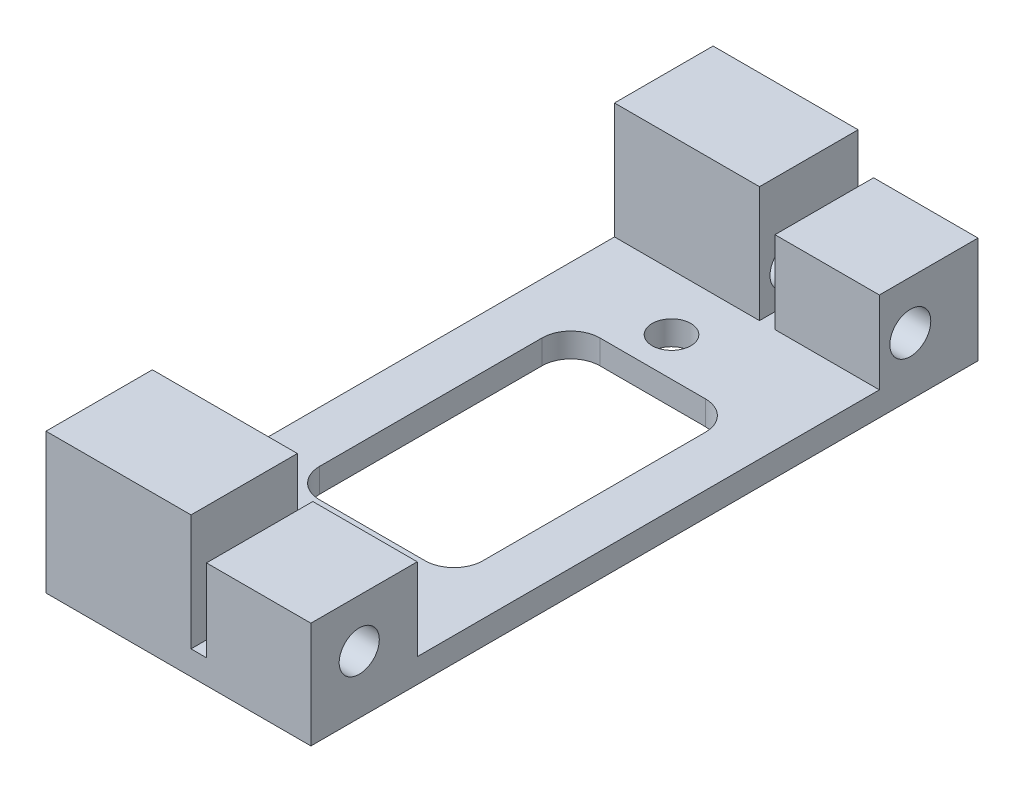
ISO-10303-21;
HEADER;
FILE_DESCRIPTION(('STEP AP214'),'2;1');
FILE_NAME('part.step','',(''),(''),'','','');
FILE_SCHEMA(('AUTOMOTIVE_DESIGN { 1 0 10303 214 1 1 1 1 }'));
ENDSEC;
DATA;
#1=APPLICATION_CONTEXT('core data for automotive mechanical design processes');
#2=APPLICATION_PROTOCOL_DEFINITION('international standard','automotive_design',2000,#1);
#3=PRODUCT_CONTEXT('',#1,'mechanical');
#4=PRODUCT('Part','Part','',(#3));
#5=PRODUCT_RELATED_PRODUCT_CATEGORY('part','',(#4));
#6=PRODUCT_DEFINITION_FORMATION('','',#4);
#7=PRODUCT_DEFINITION_CONTEXT('part definition',#1,'design');
#8=PRODUCT_DEFINITION('design','',#6,#7);
#9=PRODUCT_DEFINITION_SHAPE('','',#8);
#10=(LENGTH_UNIT() NAMED_UNIT(*) SI_UNIT(.MILLI.,.METRE.));
#11=(NAMED_UNIT(*) PLANE_ANGLE_UNIT() SI_UNIT($,.RADIAN.));
#12=(NAMED_UNIT(*) SI_UNIT($,.STERADIAN.) SOLID_ANGLE_UNIT());
#13=UNCERTAINTY_MEASURE_WITH_UNIT(LENGTH_MEASURE(1.E-05),#10,'distance_accuracy_value','');
#14=(GEOMETRIC_REPRESENTATION_CONTEXT(3) GLOBAL_UNCERTAINTY_ASSIGNED_CONTEXT((#13)) GLOBAL_UNIT_ASSIGNED_CONTEXT((#10,
#11,#12)) REPRESENTATION_CONTEXT('',''));
#15=CARTESIAN_POINT('',(0.,0.,0.));
#16=DIRECTION('',(0.,0.,1.));
#17=DIRECTION('',(1.,0.,0.));
#18=AXIS2_PLACEMENT_3D('',#15,#16,#17);
#19=CARTESIAN_POINT('',(0.,0.,0.));
#20=DIRECTION('',(0.,-1.,0.));
#21=DIRECTION('',(0.,0.,-1.));
#22=AXIS2_PLACEMENT_3D('',#19,#20,#21);
#23=PLANE('',#22);
#24=DIRECTION('',(0.,0.,1.));
#25=VECTOR('',#24,1.);
#26=CARTESIAN_POINT('',(-2.2,0.,-12.5));
#27=LINE('',#26,#25);
#28=CARTESIAN_POINT('',(-2.2,0.,-12.5));
#29=VERTEX_POINT('',#28);
#30=CARTESIAN_POINT('',(-2.2,0.,10.5));
#31=VERTEX_POINT('',#30);
#32=EDGE_CURVE('E331',#29,#31,#27,.T.);
#33=ORIENTED_EDGE('',*,*,#32,.F.);
#34=CARTESIAN_POINT('',(0.799999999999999,0.,-12.5));
#35=DIRECTION('',(0.,1.,0.));
#36=DIRECTION('',(0.,0.,1.));
#37=AXIS2_PLACEMENT_3D('',#34,#35,#36);
#38=CIRCLE('',#37,3.);
#39=CARTESIAN_POINT('',(0.800000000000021,0.,-15.5));
#40=VERTEX_POINT('',#39);
#41=EDGE_CURVE('E303',#40,#29,#38,.T.);
#42=ORIENTED_EDGE('',*,*,#41,.F.);
#43=DIRECTION('',(-1.,0.,0.));
#44=VECTOR('',#43,1.);
#45=CARTESIAN_POINT('',(0.800000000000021,0.,-15.5));
#46=LINE('',#45,#44);
#47=CARTESIAN_POINT('',(11.7,0.,-15.5));
#48=VERTEX_POINT('',#47);
#49=EDGE_CURVE('E308',#48,#40,#46,.T.);
#50=ORIENTED_EDGE('',*,*,#49,.F.);
#51=CARTESIAN_POINT('',(11.7,0.,-12.5));
#52=DIRECTION('',(0.,1.,0.));
#53=DIRECTION('',(0.,0.,-1.));
#54=AXIS2_PLACEMENT_3D('',#51,#52,#53);
#55=CIRCLE('',#54,3.);
#56=CARTESIAN_POINT('',(14.7,0.,-12.5));
#57=VERTEX_POINT('',#56);
#58=EDGE_CURVE('E346',#57,#48,#55,.T.);
#59=ORIENTED_EDGE('',*,*,#58,.F.);
#60=DIRECTION('',(0.,0.,-1.));
#61=VECTOR('',#60,1.);
#62=CARTESIAN_POINT('',(14.7,0.,-12.5));
#63=LINE('',#62,#61);
#64=CARTESIAN_POINT('',(14.7,0.,10.5));
#65=VERTEX_POINT('',#64);
#66=EDGE_CURVE('E343',#65,#57,#63,.T.);
#67=ORIENTED_EDGE('',*,*,#66,.F.);
#68=CARTESIAN_POINT('',(11.7,0.,10.5));
#69=DIRECTION('',(0.,1.,0.));
#70=DIRECTION('',(0.,0.,1.));
#71=AXIS2_PLACEMENT_3D('',#68,#69,#70);
#72=CIRCLE('',#71,3.);
#73=CARTESIAN_POINT('',(11.7,0.,13.5));
#74=VERTEX_POINT('',#73);
#75=EDGE_CURVE('E340',#74,#65,#72,.T.);
#76=ORIENTED_EDGE('',*,*,#75,.F.);
#77=DIRECTION('',(1.,0.,0.));
#78=VECTOR('',#77,1.);
#79=CARTESIAN_POINT('',(0.800000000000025,0.,13.5));
#80=LINE('',#79,#78);
#81=CARTESIAN_POINT('',(0.800000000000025,0.,13.5));
#82=VERTEX_POINT('',#81);
#83=EDGE_CURVE('E337',#82,#74,#80,.T.);
#84=ORIENTED_EDGE('',*,*,#83,.F.);
#85=CARTESIAN_POINT('',(0.800000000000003,0.,10.5));
#86=DIRECTION('',(0.,1.,0.));
#87=DIRECTION('',(0.,0.,1.));
#88=AXIS2_PLACEMENT_3D('',#85,#86,#87);
#89=CIRCLE('',#88,3.);
#90=EDGE_CURVE('E334',#31,#82,#89,.T.);
#91=ORIENTED_EDGE('',*,*,#90,.F.);
#92=EDGE_LOOP('',(#33,#42,#50,#59,#67,#76,#84,#91));
#93=FACE_BOUND('',#92,.T.);
#94=CARTESIAN_POINT('',(4.2,0.,-19.5));
#95=DIRECTION('',(0.,1.,0.));
#96=DIRECTION('',(0.,0.,1.));
#97=AXIS2_PLACEMENT_3D('',#94,#95,#96);
#98=CIRCLE('',#97,2.);
#99=CARTESIAN_POINT('',(4.2,0.,-17.5));
#100=VERTEX_POINT('',#99);
#101=EDGE_CURVE('E353',#100,#100,#98,.T.);
#102=ORIENTED_EDGE('',*,*,#101,.F.);
#103=EDGE_LOOP('',(#102));
#104=FACE_BOUND('',#103,.T.);
#105=CARTESIAN_POINT('',(4.2,0.,17.5));
#106=DIRECTION('',(0.,1.,0.));
#107=DIRECTION('',(0.,0.,1.));
#108=AXIS2_PLACEMENT_3D('',#105,#106,#107);
#109=CIRCLE('',#108,2.);
#110=CARTESIAN_POINT('',(4.2,0.,19.5));
#111=VERTEX_POINT('',#110);
#112=EDGE_CURVE('E371',#111,#111,#109,.T.);
#113=ORIENTED_EDGE('',*,*,#112,.F.);
#114=EDGE_LOOP('',(#113));
#115=FACE_BOUND('',#114,.T.);
#116=DIRECTION('',(-1.,0.,0.));
#117=VECTOR('',#116,1.);
#118=CARTESIAN_POINT('',(19.9,0.,22.5));
#119=LINE('',#118,#117);
#120=CARTESIAN_POINT('',(19.9,0.,22.5));
#121=VERTEX_POINT('',#120);
#122=CARTESIAN_POINT('',(9.10000000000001,0.,22.5));
#123=VERTEX_POINT('',#122);
#124=EDGE_CURVE('E59',#121,#123,#119,.T.);
#125=ORIENTED_EDGE('',*,*,#124,.F.);
#126=DIRECTION('',(0.,0.,-1.));
#127=VECTOR('',#126,1.);
#128=CARTESIAN_POINT('',(19.9,0.,-35.5));
#129=LINE('',#128,#127);
#130=CARTESIAN_POINT('',(19.9,0.,-25.3));
#131=VERTEX_POINT('',#130);
#132=EDGE_CURVE('E397',#121,#131,#129,.T.);
#133=ORIENTED_EDGE('',*,*,#132,.T.);
#134=DIRECTION('',(1.,0.,0.));
#135=VECTOR('',#134,1.);
#136=CARTESIAN_POINT('',(9.1,0.,-25.3));
#137=LINE('',#136,#135);
#138=CARTESIAN_POINT('',(9.1,0.,-25.3));
#139=VERTEX_POINT('',#138);
#140=EDGE_CURVE('E222',#139,#131,#137,.T.);
#141=ORIENTED_EDGE('',*,*,#140,.F.);
#142=DIRECTION('',(0.,0.,1.));
#143=VECTOR('',#142,1.);
#144=CARTESIAN_POINT('',(9.1,0.,-35.5));
#145=LINE('',#144,#143);
#146=CARTESIAN_POINT('',(9.1,0.,-35.5));
#147=VERTEX_POINT('',#146);
#148=EDGE_CURVE('E219',#147,#139,#145,.T.);
#149=ORIENTED_EDGE('',*,*,#148,.F.);
#150=DIRECTION('',(-1.,0.,0.));
#151=VECTOR('',#150,1.);
#152=CARTESIAN_POINT('',(19.9,0.,-35.5));
#153=LINE('',#152,#151);
#154=CARTESIAN_POINT('',(7.5,0.,-35.5));
#155=VERTEX_POINT('',#154);
#156=EDGE_CURVE('E384',#147,#155,#153,.T.);
#157=ORIENTED_EDGE('',*,*,#156,.T.);
#158=DIRECTION('',(0.,0.,-1.));
#159=VECTOR('',#158,1.);
#160=CARTESIAN_POINT('',(7.5,0.,-35.5));
#161=LINE('',#160,#159);
#162=CARTESIAN_POINT('',(7.5,0.,-25.3));
#163=VERTEX_POINT('',#162);
#164=EDGE_CURVE('E276',#163,#155,#161,.T.);
#165=ORIENTED_EDGE('',*,*,#164,.F.);
#166=DIRECTION('',(1.,0.,0.));
#167=VECTOR('',#166,1.);
#168=CARTESIAN_POINT('',(-7.5,0.,-25.3));
#169=LINE('',#168,#167);
#170=CARTESIAN_POINT('',(-7.5,0.,-25.3));
#171=VERTEX_POINT('',#170);
#172=EDGE_CURVE('E273',#171,#163,#169,.T.);
#173=ORIENTED_EDGE('',*,*,#172,.F.);
#174=DIRECTION('',(0.,0.,1.));
#175=VECTOR('',#174,1.);
#176=CARTESIAN_POINT('',(-7.5,0.,-35.5));
#177=LINE('',#176,#175);
#178=CARTESIAN_POINT('',(-7.49999999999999,0.,22.5));
#179=VERTEX_POINT('',#178);
#180=EDGE_CURVE('E377',#171,#179,#177,.T.);
#181=ORIENTED_EDGE('',*,*,#180,.T.);
#182=DIRECTION('',(-1.,0.,0.));
#183=VECTOR('',#182,1.);
#184=CARTESIAN_POINT('',(-7.5,0.,22.5));
#185=LINE('',#184,#183);
#186=CARTESIAN_POINT('',(7.5,0.,22.5));
#187=VERTEX_POINT('',#186);
#188=EDGE_CURVE('E291',#187,#179,#185,.T.);
#189=ORIENTED_EDGE('',*,*,#188,.F.);
#190=DIRECTION('',(0.,0.,-1.));
#191=VECTOR('',#190,1.);
#192=CARTESIAN_POINT('',(7.5,0.,22.5));
#193=LINE('',#192,#191);
#194=CARTESIAN_POINT('',(7.5,0.,33.5));
#195=VERTEX_POINT('',#194);
#196=EDGE_CURVE('E288',#195,#187,#193,.T.);
#197=ORIENTED_EDGE('',*,*,#196,.F.);
#198=DIRECTION('',(1.,0.,0.));
#199=VECTOR('',#198,1.);
#200=CARTESIAN_POINT('',(19.9,0.,33.5));
#201=LINE('',#200,#199);
#202=CARTESIAN_POINT('',(9.10000000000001,0.,33.5));
#203=VERTEX_POINT('',#202);
#204=EDGE_CURVE('E395',#195,#203,#201,.T.);
#205=ORIENTED_EDGE('',*,*,#204,.T.);
#206=DIRECTION('',(0.,0.,1.));
#207=VECTOR('',#206,1.);
#208=CARTESIAN_POINT('',(9.10000000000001,0.,22.5));
#209=LINE('',#208,#207);
#210=EDGE_CURVE('E54',#123,#203,#209,.T.);
#211=ORIENTED_EDGE('',*,*,#210,.F.);
#212=EDGE_LOOP('',(#125,#133,#141,#149,#157,#165,#173,#181,#189,#197,#205,#211));
#213=FACE_BOUND('',#212,.T.);
#214=ADVANCED_FACE('F37',(#93,#104,#115,#213),#23,.F.);
#215=CARTESIAN_POINT('',(-7.5,-2.5,-35.5));
#216=DIRECTION('',(-1.,0.,0.));
#217=DIRECTION('',(0.,0.,1.));
#218=AXIS2_PLACEMENT_3D('',#215,#216,#217);
#219=PLANE('',#218);
#220=CARTESIAN_POINT('',(-7.49999999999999,3.5,28.5));
#221=DIRECTION('',(-1.,0.,0.));
#222=DIRECTION('',(0.,0.,1.));
#223=AXIS2_PLACEMENT_3D('',#220,#221,#222);
#224=CIRCLE('',#223,2.07435792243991);
#225=CARTESIAN_POINT('',(-7.49999999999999,3.5,30.5743579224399));
#226=VERTEX_POINT('',#225);
#227=EDGE_CURVE('E410',#226,#226,#224,.T.);
#228=ORIENTED_EDGE('',*,*,#227,.F.);
#229=EDGE_LOOP('',(#228));
#230=FACE_BOUND('',#229,.T.);
#231=CARTESIAN_POINT('',(-7.5,3.5,-28.5));
#232=DIRECTION('',(-1.,0.,0.));
#233=DIRECTION('',(0.,0.,1.));
#234=AXIS2_PLACEMENT_3D('',#231,#232,#233);
#235=CIRCLE('',#234,2.11605772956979);
#236=CARTESIAN_POINT('',(-7.5,3.5,-26.3839422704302));
#237=VERTEX_POINT('',#236);
#238=EDGE_CURVE('E425',#237,#237,#235,.T.);
#239=ORIENTED_EDGE('',*,*,#238,.F.);
#240=EDGE_LOOP('',(#239));
#241=FACE_BOUND('',#240,.T.);
#242=DIRECTION('',(0.,0.,1.));
#243=VECTOR('',#242,1.);
#244=CARTESIAN_POINT('',(-7.5,12.,-35.5));
#245=LINE('',#244,#243);
#246=CARTESIAN_POINT('',(-7.5,12.,-35.5));
#247=VERTEX_POINT('',#246);
#248=CARTESIAN_POINT('',(-7.5,12.,-25.3));
#249=VERTEX_POINT('',#248);
#250=EDGE_CURVE('E249',#247,#249,#245,.T.);
#251=ORIENTED_EDGE('',*,*,#250,.F.);
#252=DIRECTION('',(0.,1.,0.));
#253=VECTOR('',#252,1.);
#254=CARTESIAN_POINT('',(-7.5,-2.5,-35.5));
#255=LINE('',#254,#253);
#256=CARTESIAN_POINT('',(-7.5,-2.5,-35.5));
#257=VERTEX_POINT('',#256);
#258=EDGE_CURVE('E11',#257,#247,#255,.T.);
#259=ORIENTED_EDGE('',*,*,#258,.F.);
#260=DIRECTION('',(0.,0.,1.));
#261=VECTOR('',#260,1.);
#262=CARTESIAN_POINT('',(-7.5,-2.5,-35.5));
#263=LINE('',#262,#261);
#264=CARTESIAN_POINT('',(-7.49999999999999,-2.5,33.5));
#265=VERTEX_POINT('',#264);
#266=EDGE_CURVE('E380',#257,#265,#263,.T.);
#267=ORIENTED_EDGE('',*,*,#266,.T.);
#268=DIRECTION('',(0.,1.,0.));
#269=VECTOR('',#268,1.);
#270=CARTESIAN_POINT('',(-7.49999999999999,-2.5,33.5));
#271=LINE('',#270,#269);
#272=CARTESIAN_POINT('',(-7.5,12.,33.5));
#273=VERTEX_POINT('',#272);
#274=EDGE_CURVE('E393',#265,#273,#271,.T.);
#275=ORIENTED_EDGE('',*,*,#274,.T.);
#276=DIRECTION('',(0.,0.,1.));
#277=VECTOR('',#276,1.);
#278=CARTESIAN_POINT('',(-7.5,12.,22.5));
#279=LINE('',#278,#277);
#280=CARTESIAN_POINT('',(-7.5,12.,22.5));
#281=VERTEX_POINT('',#280);
#282=EDGE_CURVE('E261',#281,#273,#279,.T.);
#283=ORIENTED_EDGE('',*,*,#282,.F.);
#284=DIRECTION('',(0.,-1.,0.));
#285=VECTOR('',#284,1.);
#286=CARTESIAN_POINT('',(-7.5,11.,22.5));
#287=LINE('',#286,#285);
#288=EDGE_CURVE('E294',#281,#179,#287,.T.);
#289=ORIENTED_EDGE('',*,*,#288,.T.);
#290=ORIENTED_EDGE('',*,*,#180,.F.);
#291=DIRECTION('',(0.,-1.,0.));
#292=VECTOR('',#291,1.);
#293=CARTESIAN_POINT('',(-7.5,11.,-25.3));
#294=LINE('',#293,#292);
#295=EDGE_CURVE('E285',#249,#171,#294,.T.);
#296=ORIENTED_EDGE('',*,*,#295,.F.);
#297=EDGE_LOOP('',(#251,#259,#267,#275,#283,#289,#290,#296));
#298=FACE_BOUND('',#297,.T.);
#299=ADVANCED_FACE('F39',(#230,#241,#298),#219,.T.);
#300=CARTESIAN_POINT('',(19.9,-2.5,-35.5));
#301=DIRECTION('',(0.,0.,-1.));
#302=DIRECTION('',(-1.,0.,0.));
#303=AXIS2_PLACEMENT_3D('',#300,#301,#302);
#304=PLANE('',#303);
#305=DIRECTION('',(0.,-1.,0.));
#306=VECTOR('',#305,1.);
#307=CARTESIAN_POINT('',(7.5,11.,-35.5));
#308=LINE('',#307,#306);
#309=CARTESIAN_POINT('',(7.5,12.,-35.5));
#310=VERTEX_POINT('',#309);
#311=EDGE_CURVE('E279',#310,#155,#308,.T.);
#312=ORIENTED_EDGE('',*,*,#311,.T.);
#313=ORIENTED_EDGE('',*,*,#156,.F.);
#314=DIRECTION('',(0.,-1.,0.));
#315=VECTOR('',#314,1.);
#316=CARTESIAN_POINT('',(9.1,8.5,-35.5));
#317=LINE('',#316,#315);
#318=CARTESIAN_POINT('',(9.1,8.5,-35.5));
#319=VERTEX_POINT('',#318);
#320=EDGE_CURVE('E246',#319,#147,#317,.T.);
#321=ORIENTED_EDGE('',*,*,#320,.F.);
#322=DIRECTION('',(-1.,0.,0.));
#323=VECTOR('',#322,1.);
#324=CARTESIAN_POINT('',(19.9,8.5,-35.5));
#325=LINE('',#324,#323);
#326=CARTESIAN_POINT('',(19.9,8.5,-35.5));
#327=VERTEX_POINT('',#326);
#328=EDGE_CURVE('E228',#327,#319,#325,.T.);
#329=ORIENTED_EDGE('',*,*,#328,.F.);
#330=DIRECTION('',(0.,1.,0.));
#331=VECTOR('',#330,1.);
#332=CARTESIAN_POINT('',(19.9,-2.5,-35.5));
#333=LINE('',#332,#331);
#334=CARTESIAN_POINT('',(19.9,-2.5,-35.5));
#335=VERTEX_POINT('',#334);
#336=EDGE_CURVE('E46',#335,#327,#333,.T.);
#337=ORIENTED_EDGE('',*,*,#336,.F.);
#338=DIRECTION('',(-1.,0.,0.));
#339=VECTOR('',#338,1.);
#340=CARTESIAN_POINT('',(19.9,-2.5,-35.5));
#341=LINE('',#340,#339);
#342=EDGE_CURVE('E390',#335,#257,#341,.T.);
#343=ORIENTED_EDGE('',*,*,#342,.T.);
#344=ORIENTED_EDGE('',*,*,#258,.T.);
#345=DIRECTION('',(-1.,0.,0.));
#346=VECTOR('',#345,1.);
#347=CARTESIAN_POINT('',(-7.5,12.,-35.5));
#348=LINE('',#347,#346);
#349=EDGE_CURVE('E258',#310,#247,#348,.T.);
#350=ORIENTED_EDGE('',*,*,#349,.F.);
#351=EDGE_LOOP('',(#312,#313,#321,#329,#337,#343,#344,#350));
#352=FACE_BOUND('',#351,.T.);
#353=ADVANCED_FACE('F444',(#352),#304,.T.);
#354=CARTESIAN_POINT('',(19.9,-2.5,-35.5));
#355=DIRECTION('',(1.,0.,0.));
#356=DIRECTION('',(0.,0.,-1.));
#357=AXIS2_PLACEMENT_3D('',#354,#355,#356);
#358=PLANE('',#357);
#359=CARTESIAN_POINT('',(19.9,3.5,28.5));
#360=DIRECTION('',(1.,0.,0.));
#361=DIRECTION('',(0.,0.,-1.));
#362=AXIS2_PLACEMENT_3D('',#359,#360,#361);
#363=CIRCLE('',#362,2.07435792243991);
#364=CARTESIAN_POINT('',(19.9,3.5,26.4256420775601));
#365=VERTEX_POINT('',#364);
#366=EDGE_CURVE('E406',#365,#365,#363,.T.);
#367=ORIENTED_EDGE('',*,*,#366,.F.);
#368=EDGE_LOOP('',(#367));
#369=FACE_BOUND('',#368,.T.);
#370=CARTESIAN_POINT('',(19.9,3.5,-28.5));
#371=DIRECTION('',(1.,0.,0.));
#372=DIRECTION('',(0.,0.,-1.));
#373=AXIS2_PLACEMENT_3D('',#370,#371,#372);
#374=CIRCLE('',#373,2.11605772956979);
#375=CARTESIAN_POINT('',(19.9,3.5,-30.6160577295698));
#376=VERTEX_POINT('',#375);
#377=EDGE_CURVE('E413',#376,#376,#374,.T.);
#378=ORIENTED_EDGE('',*,*,#377,.F.);
#379=EDGE_LOOP('',(#378));
#380=FACE_BOUND('',#379,.T.);
#381=ORIENTED_EDGE('',*,*,#132,.F.);
#382=DIRECTION('',(0.,-1.,0.));
#383=VECTOR('',#382,1.);
#384=CARTESIAN_POINT('',(19.9,8.5,22.5));
#385=LINE('',#384,#383);
#386=CARTESIAN_POINT('',(19.9,8.5,22.5));
#387=VERTEX_POINT('',#386);
#388=EDGE_CURVE('E224',#387,#121,#385,.T.);
#389=ORIENTED_EDGE('',*,*,#388,.F.);
#390=DIRECTION('',(0.,0.,-1.));
#391=VECTOR('',#390,1.);
#392=CARTESIAN_POINT('',(19.9,8.5,33.5));
#393=LINE('',#392,#391);
#394=CARTESIAN_POINT('',(19.9,8.5,33.5));
#395=VERTEX_POINT('',#394);
#396=EDGE_CURVE('E213',#395,#387,#393,.T.);
#397=ORIENTED_EDGE('',*,*,#396,.F.);
#398=DIRECTION('',(0.,1.,0.));
#399=VECTOR('',#398,1.);
#400=CARTESIAN_POINT('',(19.9,-2.5,33.5));
#401=LINE('',#400,#399);
#402=CARTESIAN_POINT('',(19.9,-2.5,33.5));
#403=VERTEX_POINT('',#402);
#404=EDGE_CURVE('E401',#403,#395,#401,.T.);
#405=ORIENTED_EDGE('',*,*,#404,.F.);
#406=DIRECTION('',(0.,0.,-1.));
#407=VECTOR('',#406,1.);
#408=CARTESIAN_POINT('',(19.9,-2.5,-35.5));
#409=LINE('',#408,#407);
#410=EDGE_CURVE('E387',#403,#335,#409,.T.);
#411=ORIENTED_EDGE('',*,*,#410,.T.);
#412=ORIENTED_EDGE('',*,*,#336,.T.);
#413=DIRECTION('',(0.,0.,-1.));
#414=VECTOR('',#413,1.);
#415=CARTESIAN_POINT('',(19.9,8.5,-25.3));
#416=LINE('',#415,#414);
#417=CARTESIAN_POINT('',(19.9,8.5,-25.3));
#418=VERTEX_POINT('',#417);
#419=EDGE_CURVE('E235',#418,#327,#416,.T.);
#420=ORIENTED_EDGE('',*,*,#419,.F.);
#421=DIRECTION('',(0.,-1.,0.));
#422=VECTOR('',#421,1.);
#423=CARTESIAN_POINT('',(19.9,8.5,-25.3));
#424=LINE('',#423,#422);
#425=EDGE_CURVE('E237',#418,#131,#424,.T.);
#426=ORIENTED_EDGE('',*,*,#425,.T.);
#427=EDGE_LOOP('',(#381,#389,#397,#405,#411,#412,#420,#426));
#428=FACE_BOUND('',#427,.T.);
#429=ADVANCED_FACE('F432',(#369,#380,#428),#358,.T.);
#430=CARTESIAN_POINT('',(19.9,-2.5,33.5));
#431=DIRECTION('',(0.,0.,1.));
#432=DIRECTION('',(1.,0.,0.));
#433=AXIS2_PLACEMENT_3D('',#430,#431,#432);
#434=PLANE('',#433);
#435=DIRECTION('',(1.,0.,0.));
#436=VECTOR('',#435,1.);
#437=CARTESIAN_POINT('',(-7.5,12.,33.5));
#438=LINE('',#437,#436);
#439=CARTESIAN_POINT('',(7.5,12.,33.5));
#440=VERTEX_POINT('',#439);
#441=EDGE_CURVE('E264',#273,#440,#438,.T.);
#442=ORIENTED_EDGE('',*,*,#441,.F.);
#443=ORIENTED_EDGE('',*,*,#274,.F.);
#444=DIRECTION('',(1.,0.,0.));
#445=VECTOR('',#444,1.);
#446=CARTESIAN_POINT('',(19.9,-2.5,33.5));
#447=LINE('',#446,#445);
#448=EDGE_CURVE('E383',#265,#403,#447,.T.);
#449=ORIENTED_EDGE('',*,*,#448,.T.);
#450=ORIENTED_EDGE('',*,*,#404,.T.);
#451=DIRECTION('',(1.,0.,0.));
#452=VECTOR('',#451,1.);
#453=CARTESIAN_POINT('',(9.10000000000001,8.5,33.5));
#454=LINE('',#453,#452);
#455=CARTESIAN_POINT('',(9.10000000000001,8.5,33.5));
#456=VERTEX_POINT('',#455);
#457=EDGE_CURVE('E207',#456,#395,#454,.T.);
#458=ORIENTED_EDGE('',*,*,#457,.F.);
#459=DIRECTION('',(0.,-1.,0.));
#460=VECTOR('',#459,1.);
#461=CARTESIAN_POINT('',(9.10000000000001,8.5,33.5));
#462=LINE('',#461,#460);
#463=EDGE_CURVE('E203',#456,#203,#462,.T.);
#464=ORIENTED_EDGE('',*,*,#463,.T.);
#465=ORIENTED_EDGE('',*,*,#204,.F.);
#466=DIRECTION('',(0.,-1.,0.));
#467=VECTOR('',#466,1.);
#468=CARTESIAN_POINT('',(7.5,11.,33.5));
#469=LINE('',#468,#467);
#470=EDGE_CURVE('E300',#440,#195,#469,.T.);
#471=ORIENTED_EDGE('',*,*,#470,.F.);
#472=EDGE_LOOP('',(#442,#443,#449,#450,#458,#464,#465,#471));
#473=FACE_BOUND('',#472,.T.);
#474=ADVANCED_FACE('F470',(#473),#434,.T.);
#475=CARTESIAN_POINT('',(0.,-2.5,0.));
#476=DIRECTION('',(0.,-1.,0.));
#477=DIRECTION('',(0.,0.,-1.));
#478=AXIS2_PLACEMENT_3D('',#475,#476,#477);
#479=PLANE('',#478);
#480=CARTESIAN_POINT('',(0.799999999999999,-2.5,-12.5));
#481=DIRECTION('',(0.,1.,0.));
#482=DIRECTION('',(0.,0.,1.));
#483=AXIS2_PLACEMENT_3D('',#480,#481,#482);
#484=CIRCLE('',#483,3.);
#485=CARTESIAN_POINT('',(0.800000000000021,-2.5,-15.5));
#486=VERTEX_POINT('',#485);
#487=CARTESIAN_POINT('',(-2.2,-2.5,-12.5));
#488=VERTEX_POINT('',#487);
#489=EDGE_CURVE('E304',#486,#488,#484,.T.);
#490=ORIENTED_EDGE('',*,*,#489,.T.);
#491=DIRECTION('',(0.,0.,1.));
#492=VECTOR('',#491,1.);
#493=CARTESIAN_POINT('',(-2.2,-2.5,-12.5));
#494=LINE('',#493,#492);
#495=CARTESIAN_POINT('',(-2.2,-2.5,10.5));
#496=VERTEX_POINT('',#495);
#497=EDGE_CURVE('E307',#488,#496,#494,.T.);
#498=ORIENTED_EDGE('',*,*,#497,.T.);
#499=CARTESIAN_POINT('',(0.800000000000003,-2.5,10.5));
#500=DIRECTION('',(0.,1.,0.));
#501=DIRECTION('',(0.,0.,1.));
#502=AXIS2_PLACEMENT_3D('',#499,#500,#501);
#503=CIRCLE('',#502,3.);
#504=CARTESIAN_POINT('',(0.800000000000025,-2.5,13.5));
#505=VERTEX_POINT('',#504);
#506=EDGE_CURVE('E311',#496,#505,#503,.T.);
#507=ORIENTED_EDGE('',*,*,#506,.T.);
#508=DIRECTION('',(1.,0.,0.));
#509=VECTOR('',#508,1.);
#510=CARTESIAN_POINT('',(0.800000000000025,-2.5,13.5));
#511=LINE('',#510,#509);
#512=CARTESIAN_POINT('',(11.7,-2.5,13.5));
#513=VERTEX_POINT('',#512);
#514=EDGE_CURVE('E314',#505,#513,#511,.T.);
#515=ORIENTED_EDGE('',*,*,#514,.T.);
#516=CARTESIAN_POINT('',(11.7,-2.5,10.5));
#517=DIRECTION('',(0.,1.,0.));
#518=DIRECTION('',(0.,0.,1.));
#519=AXIS2_PLACEMENT_3D('',#516,#517,#518);
#520=CIRCLE('',#519,3.);
#521=CARTESIAN_POINT('',(14.7,-2.5,10.5));
#522=VERTEX_POINT('',#521);
#523=EDGE_CURVE('E317',#513,#522,#520,.T.);
#524=ORIENTED_EDGE('',*,*,#523,.T.);
#525=DIRECTION('',(0.,0.,-1.));
#526=VECTOR('',#525,1.);
#527=CARTESIAN_POINT('',(14.7,-2.5,-12.5));
#528=LINE('',#527,#526);
#529=CARTESIAN_POINT('',(14.7,-2.5,-12.5));
#530=VERTEX_POINT('',#529);
#531=EDGE_CURVE('E320',#522,#530,#528,.T.);
#532=ORIENTED_EDGE('',*,*,#531,.T.);
#533=CARTESIAN_POINT('',(11.7,-2.5,-12.5));
#534=DIRECTION('',(0.,1.,0.));
#535=DIRECTION('',(0.,0.,-1.));
#536=AXIS2_PLACEMENT_3D('',#533,#534,#535);
#537=CIRCLE('',#536,3.);
#538=CARTESIAN_POINT('',(11.7,-2.5,-15.5));
#539=VERTEX_POINT('',#538);
#540=EDGE_CURVE('E323',#530,#539,#537,.T.);
#541=ORIENTED_EDGE('',*,*,#540,.T.);
#542=DIRECTION('',(-1.,0.,0.));
#543=VECTOR('',#542,1.);
#544=CARTESIAN_POINT('',(0.800000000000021,-2.5,-15.5));
#545=LINE('',#544,#543);
#546=EDGE_CURVE('E326',#539,#486,#545,.T.);
#547=ORIENTED_EDGE('',*,*,#546,.T.);
#548=EDGE_LOOP('',(#490,#498,#507,#515,#524,#532,#541,#547));
#549=FACE_BOUND('',#548,.T.);
#550=CARTESIAN_POINT('',(4.2,-2.5,-19.5));
#551=DIRECTION('',(0.,1.,0.));
#552=DIRECTION('',(0.,0.,1.));
#553=AXIS2_PLACEMENT_3D('',#550,#551,#552);
#554=CIRCLE('',#553,2.);
#555=CARTESIAN_POINT('',(4.2,-2.5,-17.5));
#556=VERTEX_POINT('',#555);
#557=EDGE_CURVE('E368',#556,#556,#554,.T.);
#558=ORIENTED_EDGE('',*,*,#557,.T.);
#559=EDGE_LOOP('',(#558));
#560=FACE_BOUND('',#559,.T.);
#561=CARTESIAN_POINT('',(4.2,-2.5,17.5));
#562=DIRECTION('',(0.,1.,0.));
#563=DIRECTION('',(0.,0.,1.));
#564=AXIS2_PLACEMENT_3D('',#561,#562,#563);
#565=CIRCLE('',#564,2.);
#566=CARTESIAN_POINT('',(4.2,-2.5,19.5));
#567=VERTEX_POINT('',#566);
#568=EDGE_CURVE('E374',#567,#567,#565,.T.);
#569=ORIENTED_EDGE('',*,*,#568,.T.);
#570=EDGE_LOOP('',(#569));
#571=FACE_BOUND('',#570,.T.);
#572=ORIENTED_EDGE('',*,*,#266,.F.);
#573=ORIENTED_EDGE('',*,*,#342,.F.);
#574=ORIENTED_EDGE('',*,*,#410,.F.);
#575=ORIENTED_EDGE('',*,*,#448,.F.);
#576=EDGE_LOOP('',(#572,#573,#574,#575));
#577=FACE_BOUND('',#576,.T.);
#578=ADVANCED_FACE('F476',(#549,#560,#571,#577),#479,.T.);
#579=CARTESIAN_POINT('',(4.2,-2.5,17.5));
#580=DIRECTION('',(0.,1.,0.));
#581=DIRECTION('',(0.,0.,1.));
#582=AXIS2_PLACEMENT_3D('',#579,#580,#581);
#583=CYLINDRICAL_SURFACE('',#582,2.);
#584=ORIENTED_EDGE('',*,*,#568,.F.);
#585=EDGE_LOOP('',(#584));
#586=FACE_BOUND('',#585,.T.);
#587=ORIENTED_EDGE('',*,*,#112,.T.);
#588=EDGE_LOOP('',(#587));
#589=FACE_BOUND('',#588,.T.);
#590=ADVANCED_FACE('F507',(#586,#589),#583,.F.);
#591=CARTESIAN_POINT('',(4.2,-2.5,-19.5));
#592=DIRECTION('',(0.,1.,0.));
#593=DIRECTION('',(0.,0.,1.));
#594=AXIS2_PLACEMENT_3D('',#591,#592,#593);
#595=CYLINDRICAL_SURFACE('',#594,2.);
#596=ORIENTED_EDGE('',*,*,#557,.F.);
#597=EDGE_LOOP('',(#596));
#598=FACE_BOUND('',#597,.T.);
#599=ORIENTED_EDGE('',*,*,#101,.T.);
#600=EDGE_LOOP('',(#599));
#601=FACE_BOUND('',#600,.T.);
#602=ADVANCED_FACE('F512',(#598,#601),#595,.F.);
#603=CARTESIAN_POINT('',(0.799999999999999,-2.5,-12.5));
#604=DIRECTION('',(0.,1.,0.));
#605=DIRECTION('',(0.,0.,1.));
#606=AXIS2_PLACEMENT_3D('',#603,#604,#605);
#607=CYLINDRICAL_SURFACE('',#606,3.);
#608=ORIENTED_EDGE('',*,*,#41,.T.);
#609=DIRECTION('',(0.,1.,0.));
#610=VECTOR('',#609,1.);
#611=CARTESIAN_POINT('',(-2.2,-2.5,-12.5));
#612=LINE('',#611,#610);
#613=EDGE_CURVE('E329',#488,#29,#612,.T.);
#614=ORIENTED_EDGE('',*,*,#613,.F.);
#615=ORIENTED_EDGE('',*,*,#489,.F.);
#616=DIRECTION('',(0.,1.,0.));
#617=VECTOR('',#616,1.);
#618=CARTESIAN_POINT('',(0.800000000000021,-2.5,-15.5));
#619=LINE('',#618,#617);
#620=EDGE_CURVE('E351',#486,#40,#619,.T.);
#621=ORIENTED_EDGE('',*,*,#620,.T.);
#622=EDGE_LOOP('',(#608,#614,#615,#621));
#623=FACE_BOUND('',#622,.T.);
#624=ADVANCED_FACE('F525',(#623),#607,.F.);
#625=CARTESIAN_POINT('',(0.800000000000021,-2.5,-15.5));
#626=DIRECTION('',(0.,0.,-1.));
#627=DIRECTION('',(-1.,0.,0.));
#628=AXIS2_PLACEMENT_3D('',#625,#626,#627);
#629=PLANE('',#628);
#630=ORIENTED_EDGE('',*,*,#49,.T.);
#631=ORIENTED_EDGE('',*,*,#620,.F.);
#632=ORIENTED_EDGE('',*,*,#546,.F.);
#633=DIRECTION('',(0.,1.,0.));
#634=VECTOR('',#633,1.);
#635=CARTESIAN_POINT('',(11.7,-2.5,-15.5));
#636=LINE('',#635,#634);
#637=EDGE_CURVE('E354',#539,#48,#636,.T.);
#638=ORIENTED_EDGE('',*,*,#637,.T.);
#639=EDGE_LOOP('',(#630,#631,#632,#638));
#640=FACE_BOUND('',#639,.T.);
#641=ADVANCED_FACE('F531',(#640),#629,.F.);
#642=CARTESIAN_POINT('',(11.7,-2.5,-12.5));
#643=DIRECTION('',(0.,1.,0.));
#644=DIRECTION('',(0.,0.,1.));
#645=AXIS2_PLACEMENT_3D('',#642,#643,#644);
#646=CYLINDRICAL_SURFACE('',#645,3.);
#647=ORIENTED_EDGE('',*,*,#58,.T.);
#648=ORIENTED_EDGE('',*,*,#637,.F.);
#649=ORIENTED_EDGE('',*,*,#540,.F.);
#650=DIRECTION('',(0.,1.,0.));
#651=VECTOR('',#650,1.);
#652=CARTESIAN_POINT('',(14.7,-2.5,-12.5));
#653=LINE('',#652,#651);
#654=EDGE_CURVE('E356',#530,#57,#653,.T.);
#655=ORIENTED_EDGE('',*,*,#654,.T.);
#656=EDGE_LOOP('',(#647,#648,#649,#655));
#657=FACE_BOUND('',#656,.T.);
#658=ADVANCED_FACE('F554',(#657),#646,.F.);
#659=CARTESIAN_POINT('',(14.7,-2.5,-12.5));
#660=DIRECTION('',(1.,0.,0.));
#661=DIRECTION('',(0.,0.,-1.));
#662=AXIS2_PLACEMENT_3D('',#659,#660,#661);
#663=PLANE('',#662);
#664=ORIENTED_EDGE('',*,*,#66,.T.);
#665=ORIENTED_EDGE('',*,*,#654,.F.);
#666=ORIENTED_EDGE('',*,*,#531,.F.);
#667=DIRECTION('',(0.,1.,0.));
#668=VECTOR('',#667,1.);
#669=CARTESIAN_POINT('',(14.7,-2.5,10.5));
#670=LINE('',#669,#668);
#671=EDGE_CURVE('E358',#522,#65,#670,.T.);
#672=ORIENTED_EDGE('',*,*,#671,.T.);
#673=EDGE_LOOP('',(#664,#665,#666,#672));
#674=FACE_BOUND('',#673,.T.);
#675=ADVANCED_FACE('F550',(#674),#663,.F.);
#676=CARTESIAN_POINT('',(11.7,-2.5,10.5));
#677=DIRECTION('',(0.,1.,0.));
#678=DIRECTION('',(0.,0.,1.));
#679=AXIS2_PLACEMENT_3D('',#676,#677,#678);
#680=CYLINDRICAL_SURFACE('',#679,3.);
#681=ORIENTED_EDGE('',*,*,#75,.T.);
#682=ORIENTED_EDGE('',*,*,#671,.F.);
#683=ORIENTED_EDGE('',*,*,#523,.F.);
#684=DIRECTION('',(0.,1.,0.));
#685=VECTOR('',#684,1.);
#686=CARTESIAN_POINT('',(11.7,-2.5,13.5));
#687=LINE('',#686,#685);
#688=EDGE_CURVE('E360',#513,#74,#687,.T.);
#689=ORIENTED_EDGE('',*,*,#688,.T.);
#690=EDGE_LOOP('',(#681,#682,#683,#689));
#691=FACE_BOUND('',#690,.T.);
#692=ADVANCED_FACE('F546',(#691),#680,.F.);
#693=CARTESIAN_POINT('',(0.800000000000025,-2.5,13.5));
#694=DIRECTION('',(0.,0.,1.));
#695=DIRECTION('',(1.,0.,0.));
#696=AXIS2_PLACEMENT_3D('',#693,#694,#695);
#697=PLANE('',#696);
#698=ORIENTED_EDGE('',*,*,#83,.T.);
#699=ORIENTED_EDGE('',*,*,#688,.F.);
#700=ORIENTED_EDGE('',*,*,#514,.F.);
#701=DIRECTION('',(0.,1.,0.));
#702=VECTOR('',#701,1.);
#703=CARTESIAN_POINT('',(0.800000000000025,-2.5,13.5));
#704=LINE('',#703,#702);
#705=EDGE_CURVE('E362',#505,#82,#704,.T.);
#706=ORIENTED_EDGE('',*,*,#705,.T.);
#707=EDGE_LOOP('',(#698,#699,#700,#706));
#708=FACE_BOUND('',#707,.T.);
#709=ADVANCED_FACE('F542',(#708),#697,.F.);
#710=CARTESIAN_POINT('',(0.800000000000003,-2.5,10.5));
#711=DIRECTION('',(0.,1.,0.));
#712=DIRECTION('',(0.,0.,1.));
#713=AXIS2_PLACEMENT_3D('',#710,#711,#712);
#714=CYLINDRICAL_SURFACE('',#713,3.);
#715=ORIENTED_EDGE('',*,*,#90,.T.);
#716=ORIENTED_EDGE('',*,*,#705,.F.);
#717=ORIENTED_EDGE('',*,*,#506,.F.);
#718=DIRECTION('',(0.,1.,0.));
#719=VECTOR('',#718,1.);
#720=CARTESIAN_POINT('',(-2.2,-2.5,10.5));
#721=LINE('',#720,#719);
#722=EDGE_CURVE('E364',#496,#31,#721,.T.);
#723=ORIENTED_EDGE('',*,*,#722,.T.);
#724=EDGE_LOOP('',(#715,#716,#717,#723));
#725=FACE_BOUND('',#724,.T.);
#726=ADVANCED_FACE('F538',(#725),#714,.F.);
#727=CARTESIAN_POINT('',(-2.2,-2.5,-12.5));
#728=DIRECTION('',(-1.,0.,0.));
#729=DIRECTION('',(0.,0.,1.));
#730=AXIS2_PLACEMENT_3D('',#727,#728,#729);
#731=PLANE('',#730);
#732=ORIENTED_EDGE('',*,*,#32,.T.);
#733=ORIENTED_EDGE('',*,*,#722,.F.);
#734=ORIENTED_EDGE('',*,*,#497,.F.);
#735=ORIENTED_EDGE('',*,*,#613,.T.);
#736=EDGE_LOOP('',(#732,#733,#734,#735));
#737=FACE_BOUND('',#736,.T.);
#738=ADVANCED_FACE('F535',(#737),#731,.F.);
#739=CARTESIAN_POINT('',(7.5,11.,22.5));
#740=DIRECTION('',(-1.,0.,0.));
#741=DIRECTION('',(0.,0.,1.));
#742=AXIS2_PLACEMENT_3D('',#739,#740,#741);
#743=PLANE('',#742);
#744=CARTESIAN_POINT('',(7.5,3.5,28.5));
#745=DIRECTION('',(-1.,0.,0.));
#746=DIRECTION('',(0.,0.,1.));
#747=AXIS2_PLACEMENT_3D('',#744,#745,#746);
#748=CIRCLE('',#747,2.07435792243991);
#749=CARTESIAN_POINT('',(7.5,3.5,30.5743579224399));
#750=VERTEX_POINT('',#749);
#751=EDGE_CURVE('E405',#750,#750,#748,.T.);
#752=ORIENTED_EDGE('',*,*,#751,.T.);
#753=EDGE_LOOP('',(#752));
#754=FACE_BOUND('',#753,.T.);
#755=ORIENTED_EDGE('',*,*,#196,.T.);
#756=DIRECTION('',(0.,-1.,0.));
#757=VECTOR('',#756,1.);
#758=CARTESIAN_POINT('',(7.5,11.,22.5));
#759=LINE('',#758,#757);
#760=CARTESIAN_POINT('',(7.5,12.,22.5));
#761=VERTEX_POINT('',#760);
#762=EDGE_CURVE('E297',#761,#187,#759,.T.);
#763=ORIENTED_EDGE('',*,*,#762,.F.);
#764=DIRECTION('',(0.,0.,-1.));
#765=VECTOR('',#764,1.);
#766=CARTESIAN_POINT('',(7.5,12.,22.5));
#767=LINE('',#766,#765);
#768=EDGE_CURVE('E267',#440,#761,#767,.T.);
#769=ORIENTED_EDGE('',*,*,#768,.F.);
#770=ORIENTED_EDGE('',*,*,#470,.T.);
#771=EDGE_LOOP('',(#755,#763,#769,#770));
#772=FACE_BOUND('',#771,.T.);
#773=ADVANCED_FACE('F467',(#754,#772),#743,.F.);
#774=CARTESIAN_POINT('',(-7.5,11.,22.5));
#775=DIRECTION('',(0.,0.,1.));
#776=DIRECTION('',(1.,0.,0.));
#777=AXIS2_PLACEMENT_3D('',#774,#775,#776);
#778=PLANE('',#777);
#779=ORIENTED_EDGE('',*,*,#188,.T.);
#780=ORIENTED_EDGE('',*,*,#288,.F.);
#781=DIRECTION('',(-1.,0.,0.));
#782=VECTOR('',#781,1.);
#783=CARTESIAN_POINT('',(-7.5,12.,22.5));
#784=LINE('',#783,#782);
#785=EDGE_CURVE('E270',#761,#281,#784,.T.);
#786=ORIENTED_EDGE('',*,*,#785,.F.);
#787=ORIENTED_EDGE('',*,*,#762,.T.);
#788=EDGE_LOOP('',(#779,#780,#786,#787));
#789=FACE_BOUND('',#788,.T.);
#790=ADVANCED_FACE('F461',(#789),#778,.F.);
#791=CARTESIAN_POINT('',(-7.5,11.,-25.3));
#792=DIRECTION('',(0.,0.,-1.));
#793=DIRECTION('',(-1.,0.,0.));
#794=AXIS2_PLACEMENT_3D('',#791,#792,#793);
#795=PLANE('',#794);
#796=ORIENTED_EDGE('',*,*,#172,.T.);
#797=DIRECTION('',(0.,-1.,0.));
#798=VECTOR('',#797,1.);
#799=CARTESIAN_POINT('',(7.5,11.,-25.3));
#800=LINE('',#799,#798);
#801=CARTESIAN_POINT('',(7.5,12.,-25.3));
#802=VERTEX_POINT('',#801);
#803=EDGE_CURVE('E282',#802,#163,#800,.T.);
#804=ORIENTED_EDGE('',*,*,#803,.F.);
#805=DIRECTION('',(1.,0.,0.));
#806=VECTOR('',#805,1.);
#807=CARTESIAN_POINT('',(-7.5,12.,-25.3));
#808=LINE('',#807,#806);
#809=EDGE_CURVE('E252',#249,#802,#808,.T.);
#810=ORIENTED_EDGE('',*,*,#809,.F.);
#811=ORIENTED_EDGE('',*,*,#295,.T.);
#812=EDGE_LOOP('',(#796,#804,#810,#811));
#813=FACE_BOUND('',#812,.T.);
#814=ADVANCED_FACE('F455',(#813),#795,.F.);
#815=CARTESIAN_POINT('',(7.5,11.,-35.5));
#816=DIRECTION('',(-1.,0.,0.));
#817=DIRECTION('',(0.,0.,1.));
#818=AXIS2_PLACEMENT_3D('',#815,#816,#817);
#819=PLANE('',#818);
#820=CARTESIAN_POINT('',(7.5,3.5,-28.5));
#821=DIRECTION('',(-1.,0.,0.));
#822=DIRECTION('',(0.,0.,1.));
#823=AXIS2_PLACEMENT_3D('',#820,#821,#822);
#824=CIRCLE('',#823,2.11605772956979);
#825=CARTESIAN_POINT('',(7.5,3.5,-26.3839422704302));
#826=VERTEX_POINT('',#825);
#827=EDGE_CURVE('E422',#826,#826,#824,.T.);
#828=ORIENTED_EDGE('',*,*,#827,.T.);
#829=EDGE_LOOP('',(#828));
#830=FACE_BOUND('',#829,.T.);
#831=ORIENTED_EDGE('',*,*,#164,.T.);
#832=ORIENTED_EDGE('',*,*,#311,.F.);
#833=DIRECTION('',(0.,0.,-1.));
#834=VECTOR('',#833,1.);
#835=CARTESIAN_POINT('',(7.5,12.,-35.5));
#836=LINE('',#835,#834);
#837=EDGE_CURVE('E255',#802,#310,#836,.T.);
#838=ORIENTED_EDGE('',*,*,#837,.F.);
#839=ORIENTED_EDGE('',*,*,#803,.T.);
#840=EDGE_LOOP('',(#831,#832,#838,#839));
#841=FACE_BOUND('',#840,.T.);
#842=ADVANCED_FACE('F449',(#830,#841),#819,.F.);
#843=CARTESIAN_POINT('',(0.,12.,0.));
#844=DIRECTION('',(0.,1.,0.));
#845=DIRECTION('',(0.,0.,1.));
#846=AXIS2_PLACEMENT_3D('',#843,#844,#845);
#847=PLANE('',#846);
#848=ORIENTED_EDGE('',*,*,#282,.T.);
#849=ORIENTED_EDGE('',*,*,#441,.T.);
#850=ORIENTED_EDGE('',*,*,#768,.T.);
#851=ORIENTED_EDGE('',*,*,#785,.T.);
#852=EDGE_LOOP('',(#848,#849,#850,#851));
#853=FACE_BOUND('',#852,.T.);
#854=ADVANCED_FACE('F463',(#853),#847,.T.);
#855=CARTESIAN_POINT('',(0.,12.,0.));
#856=DIRECTION('',(0.,1.,0.));
#857=DIRECTION('',(0.,0.,1.));
#858=AXIS2_PLACEMENT_3D('',#855,#856,#857);
#859=PLANE('',#858);
#860=ORIENTED_EDGE('',*,*,#250,.T.);
#861=ORIENTED_EDGE('',*,*,#809,.T.);
#862=ORIENTED_EDGE('',*,*,#837,.T.);
#863=ORIENTED_EDGE('',*,*,#349,.T.);
#864=EDGE_LOOP('',(#860,#861,#862,#863));
#865=FACE_BOUND('',#864,.T.);
#866=ADVANCED_FACE('F451',(#865),#859,.T.);
#867=CARTESIAN_POINT('',(9.1,8.5,-35.5));
#868=DIRECTION('',(1.,0.,0.));
#869=DIRECTION('',(0.,0.,-1.));
#870=AXIS2_PLACEMENT_3D('',#867,#868,#869);
#871=PLANE('',#870);
#872=CARTESIAN_POINT('',(9.1,3.5,-28.5));
#873=DIRECTION('',(1.,0.,0.));
#874=DIRECTION('',(0.,0.,-1.));
#875=AXIS2_PLACEMENT_3D('',#872,#873,#874);
#876=CIRCLE('',#875,2.11605772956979);
#877=CARTESIAN_POINT('',(9.1,3.5,-30.6160577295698));
#878=VERTEX_POINT('',#877);
#879=EDGE_CURVE('E41',#878,#878,#876,.T.);
#880=ORIENTED_EDGE('',*,*,#879,.T.);
#881=EDGE_LOOP('',(#880));
#882=FACE_BOUND('',#881,.T.);
#883=ORIENTED_EDGE('',*,*,#148,.T.);
#884=DIRECTION('',(0.,-1.,0.));
#885=VECTOR('',#884,1.);
#886=CARTESIAN_POINT('',(9.1,8.5,-25.3));
#887=LINE('',#886,#885);
#888=CARTESIAN_POINT('',(9.1,8.5,-25.3));
#889=VERTEX_POINT('',#888);
#890=EDGE_CURVE('E243',#889,#139,#887,.T.);
#891=ORIENTED_EDGE('',*,*,#890,.F.);
#892=DIRECTION('',(0.,0.,1.));
#893=VECTOR('',#892,1.);
#894=CARTESIAN_POINT('',(9.1,8.5,-35.5));
#895=LINE('',#894,#893);
#896=EDGE_CURVE('E231',#319,#889,#895,.T.);
#897=ORIENTED_EDGE('',*,*,#896,.F.);
#898=ORIENTED_EDGE('',*,*,#320,.T.);
#899=EDGE_LOOP('',(#883,#891,#897,#898));
#900=FACE_BOUND('',#899,.T.);
#901=ADVANCED_FACE('F440',(#882,#900),#871,.F.);
#902=CARTESIAN_POINT('',(9.1,8.5,-25.3));
#903=DIRECTION('',(0.,0.,-1.));
#904=DIRECTION('',(-1.,0.,0.));
#905=AXIS2_PLACEMENT_3D('',#902,#903,#904);
#906=PLANE('',#905);
#907=ORIENTED_EDGE('',*,*,#140,.T.);
#908=ORIENTED_EDGE('',*,*,#425,.F.);
#909=DIRECTION('',(1.,0.,0.));
#910=VECTOR('',#909,1.);
#911=CARTESIAN_POINT('',(9.1,8.5,-25.3));
#912=LINE('',#911,#910);
#913=EDGE_CURVE('E233',#889,#418,#912,.T.);
#914=ORIENTED_EDGE('',*,*,#913,.F.);
#915=ORIENTED_EDGE('',*,*,#890,.T.);
#916=EDGE_LOOP('',(#907,#908,#914,#915));
#917=FACE_BOUND('',#916,.T.);
#918=ADVANCED_FACE('F436',(#917),#906,.F.);
#919=CARTESIAN_POINT('',(0.,8.5,0.));
#920=DIRECTION('',(0.,1.,0.));
#921=DIRECTION('',(0.,0.,1.));
#922=AXIS2_PLACEMENT_3D('',#919,#920,#921);
#923=PLANE('',#922);
#924=ORIENTED_EDGE('',*,*,#328,.T.);
#925=ORIENTED_EDGE('',*,*,#896,.T.);
#926=ORIENTED_EDGE('',*,*,#913,.T.);
#927=ORIENTED_EDGE('',*,*,#419,.T.);
#928=EDGE_LOOP('',(#924,#925,#926,#927));
#929=FACE_BOUND('',#928,.T.);
#930=ADVANCED_FACE('F478',(#929),#923,.T.);
#931=CARTESIAN_POINT('',(19.9,8.5,22.5));
#932=DIRECTION('',(0.,0.,1.));
#933=DIRECTION('',(1.,0.,0.));
#934=AXIS2_PLACEMENT_3D('',#931,#932,#933);
#935=PLANE('',#934);
#936=ORIENTED_EDGE('',*,*,#124,.T.);
#937=DIRECTION('',(0.,-1.,0.));
#938=VECTOR('',#937,1.);
#939=CARTESIAN_POINT('',(9.10000000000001,8.5,22.5));
#940=LINE('',#939,#938);
#941=CARTESIAN_POINT('',(9.10000000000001,8.5,22.5));
#942=VERTEX_POINT('',#941);
#943=EDGE_CURVE('E201',#942,#123,#940,.T.);
#944=ORIENTED_EDGE('',*,*,#943,.F.);
#945=DIRECTION('',(-1.,0.,0.));
#946=VECTOR('',#945,1.);
#947=CARTESIAN_POINT('',(19.9,8.5,22.5));
#948=LINE('',#947,#946);
#949=EDGE_CURVE('E208',#387,#942,#948,.T.);
#950=ORIENTED_EDGE('',*,*,#949,.F.);
#951=ORIENTED_EDGE('',*,*,#388,.T.);
#952=EDGE_LOOP('',(#936,#944,#950,#951));
#953=FACE_BOUND('',#952,.T.);
#954=ADVANCED_FACE('F218',(#953),#935,.F.);
#955=CARTESIAN_POINT('',(9.10000000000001,8.5,22.5));
#956=DIRECTION('',(1.,0.,0.));
#957=DIRECTION('',(0.,0.,-1.));
#958=AXIS2_PLACEMENT_3D('',#955,#956,#957);
#959=PLANE('',#958);
#960=CARTESIAN_POINT('',(9.10000000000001,3.5,28.5));
#961=DIRECTION('',(1.,0.,0.));
#962=DIRECTION('',(0.,0.,-1.));
#963=AXIS2_PLACEMENT_3D('',#960,#961,#962);
#964=CIRCLE('',#963,2.07435792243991);
#965=CARTESIAN_POINT('',(9.10000000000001,3.5,26.4256420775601));
#966=VERTEX_POINT('',#965);
#967=EDGE_CURVE('E403',#966,#966,#964,.T.);
#968=ORIENTED_EDGE('',*,*,#967,.T.);
#969=EDGE_LOOP('',(#968));
#970=FACE_BOUND('',#969,.T.);
#971=ORIENTED_EDGE('',*,*,#210,.T.);
#972=ORIENTED_EDGE('',*,*,#463,.F.);
#973=DIRECTION('',(0.,0.,1.));
#974=VECTOR('',#973,1.);
#975=CARTESIAN_POINT('',(9.10000000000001,8.5,22.5));
#976=LINE('',#975,#974);
#977=EDGE_CURVE('E197',#942,#456,#976,.T.);
#978=ORIENTED_EDGE('',*,*,#977,.F.);
#979=ORIENTED_EDGE('',*,*,#943,.T.);
#980=EDGE_LOOP('',(#971,#972,#978,#979));
#981=FACE_BOUND('',#980,.T.);
#982=ADVANCED_FACE('F199',(#970,#981),#959,.F.);
#983=CARTESIAN_POINT('',(0.,8.5,0.));
#984=DIRECTION('',(0.,1.,0.));
#985=DIRECTION('',(0.,0.,1.));
#986=AXIS2_PLACEMENT_3D('',#983,#984,#985);
#987=PLANE('',#986);
#988=ORIENTED_EDGE('',*,*,#949,.T.);
#989=ORIENTED_EDGE('',*,*,#977,.T.);
#990=ORIENTED_EDGE('',*,*,#457,.T.);
#991=ORIENTED_EDGE('',*,*,#396,.T.);
#992=EDGE_LOOP('',(#988,#989,#990,#991));
#993=FACE_BOUND('',#992,.T.);
#994=ADVANCED_FACE('F211',(#993),#987,.T.);
#995=CARTESIAN_POINT('',(-20.1,3.5,28.5));
#996=DIRECTION('',(1.,0.,0.));
#997=DIRECTION('',(0.,0.,-1.));
#998=AXIS2_PLACEMENT_3D('',#995,#996,#997);
#999=CYLINDRICAL_SURFACE('',#998,2.07435792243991);
#1000=ORIENTED_EDGE('',*,*,#366,.T.);
#1001=EDGE_LOOP('',(#1000));
#1002=FACE_BOUND('',#1001,.T.);
#1003=ORIENTED_EDGE('',*,*,#967,.F.);
#1004=EDGE_LOOP('',(#1003));
#1005=FACE_BOUND('',#1004,.T.);
#1006=ADVANCED_FACE('F586',(#1002,#1005),#999,.F.);
#1007=CARTESIAN_POINT('',(-20.1,3.5,-28.5));
#1008=DIRECTION('',(1.,0.,0.));
#1009=DIRECTION('',(0.,0.,-1.));
#1010=AXIS2_PLACEMENT_3D('',#1007,#1008,#1009);
#1011=CYLINDRICAL_SURFACE('',#1010,2.11605772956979);
#1012=ORIENTED_EDGE('',*,*,#377,.T.);
#1013=EDGE_LOOP('',(#1012));
#1014=FACE_BOUND('',#1013,.T.);
#1015=ORIENTED_EDGE('',*,*,#879,.F.);
#1016=EDGE_LOOP('',(#1015));
#1017=FACE_BOUND('',#1016,.T.);
#1018=ADVANCED_FACE('F583',(#1014,#1017),#1011,.F.);
#1019=ORIENTED_EDGE('',*,*,#238,.T.);
#1020=EDGE_LOOP('',(#1019));
#1021=FACE_BOUND('',#1020,.T.);
#1022=ORIENTED_EDGE('',*,*,#827,.F.);
#1023=EDGE_LOOP('',(#1022));
#1024=FACE_BOUND('',#1023,.T.);
#1025=ADVANCED_FACE('F585',(#1021,#1024),#1011,.F.);
#1026=ORIENTED_EDGE('',*,*,#227,.T.);
#1027=EDGE_LOOP('',(#1026));
#1028=FACE_BOUND('',#1027,.T.);
#1029=ORIENTED_EDGE('',*,*,#751,.F.);
#1030=EDGE_LOOP('',(#1029));
#1031=FACE_BOUND('',#1030,.T.);
#1032=ADVANCED_FACE('F593',(#1028,#1031),#999,.F.);
#1033=CLOSED_SHELL('',(#214,#299,#353,#429,#474,#578,#590,#602,#624,#641,#658,#675,#692,#709,
#726,#738,#773,#790,#814,#842,#854,#866,#901,#918,#930,#954,#982,#994,#1006,#1018,#1025,#1032));
#1034=MANIFOLD_SOLID_BREP('B2',#1033);
#1035=ADVANCED_BREP_SHAPE_REPRESENTATION('',(#18,#1034),#14);
#1036=SHAPE_DEFINITION_REPRESENTATION(#9,#1035);
ENDSEC;
END-ISO-10303-21;
